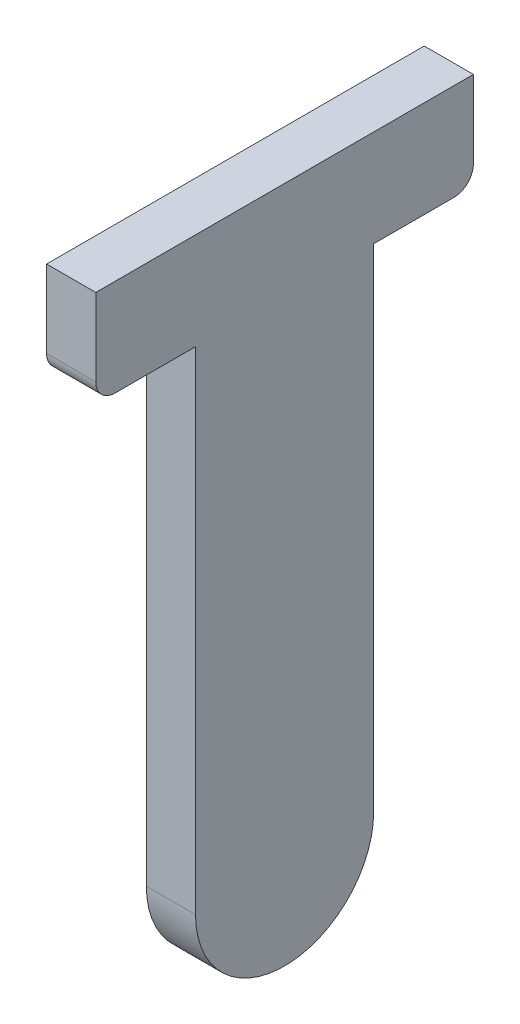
ISO-10303-21;
HEADER;
FILE_DESCRIPTION(('STEP AP214'),'2;1');
FILE_NAME('part.step','',(''),(''),'','','');
FILE_SCHEMA(('AUTOMOTIVE_DESIGN { 1 0 10303 214 1 1 1 1 }'));
ENDSEC;
DATA;
#1=APPLICATION_CONTEXT('core data for automotive mechanical design processes');
#2=APPLICATION_PROTOCOL_DEFINITION('international standard','automotive_design',2000,#1);
#3=PRODUCT_CONTEXT('',#1,'mechanical');
#4=PRODUCT('Part','Part','',(#3));
#5=PRODUCT_RELATED_PRODUCT_CATEGORY('part','',(#4));
#6=PRODUCT_DEFINITION_FORMATION('','',#4);
#7=PRODUCT_DEFINITION_CONTEXT('part definition',#1,'design');
#8=PRODUCT_DEFINITION('design','',#6,#7);
#9=PRODUCT_DEFINITION_SHAPE('','',#8);
#10=(LENGTH_UNIT() NAMED_UNIT(*) SI_UNIT(.MILLI.,.METRE.));
#11=(NAMED_UNIT(*) PLANE_ANGLE_UNIT() SI_UNIT($,.RADIAN.));
#12=(NAMED_UNIT(*) SI_UNIT($,.STERADIAN.) SOLID_ANGLE_UNIT());
#13=UNCERTAINTY_MEASURE_WITH_UNIT(LENGTH_MEASURE(1.E-05),#10,'distance_accuracy_value','');
#14=(GEOMETRIC_REPRESENTATION_CONTEXT(3) GLOBAL_UNCERTAINTY_ASSIGNED_CONTEXT((#13)) GLOBAL_UNIT_ASSIGNED_CONTEXT((#10,
#11,#12)) REPRESENTATION_CONTEXT('',''));
#15=CARTESIAN_POINT('',(0.,0.,0.));
#16=DIRECTION('',(0.,0.,1.));
#17=DIRECTION('',(1.,0.,0.));
#18=AXIS2_PLACEMENT_3D('',#15,#16,#17);
#19=CARTESIAN_POINT('',(7.25,0.,0.));
#20=DIRECTION('',(1.,0.,0.));
#21=DIRECTION('',(0.,0.,-1.));
#22=AXIS2_PLACEMENT_3D('',#19,#20,#21);
#23=PLANE('',#22);
#24=DIRECTION('',(0.,0.,1.));
#25=VECTOR('',#24,1.);
#26=CARTESIAN_POINT('',(7.25,-9.21,-17.475));
#27=LINE('',#26,#25);
#28=CARTESIAN_POINT('',(7.25,-9.21,-15.525));
#29=VERTEX_POINT('',#28);
#30=CARTESIAN_POINT('',(7.25,-9.21,-17.475));
#31=VERTEX_POINT('',#30);
#32=EDGE_CURVE('E84',#29,#31,#27,.F.);
#33=ORIENTED_EDGE('',*,*,#32,.F.);
#34=DIRECTION('',(0.,1.,0.));
#35=VECTOR('',#34,1.);
#36=CARTESIAN_POINT('',(7.25,0.,-15.525));
#37=LINE('',#36,#35);
#38=CARTESIAN_POINT('',(7.25,-9.61,-15.525));
#39=VERTEX_POINT('',#38);
#40=EDGE_CURVE('E99',#29,#39,#37,.F.);
#41=ORIENTED_EDGE('',*,*,#40,.T.);
#42=CARTESIAN_POINT('',(7.25,-9.61,-15.625));
#43=DIRECTION('',(-1.,0.,0.));
#44=DIRECTION('',(0.,0.,1.));
#45=AXIS2_PLACEMENT_3D('',#42,#43,#44);
#46=CIRCLE('',#45,0.1);
#47=CARTESIAN_POINT('',(7.25,-9.71,-15.625));
#48=VERTEX_POINT('',#47);
#49=EDGE_CURVE('E20',#39,#48,#46,.F.);
#50=ORIENTED_EDGE('',*,*,#49,.T.);
#51=DIRECTION('',(0.,0.,-1.));
#52=VECTOR('',#51,1.);
#53=CARTESIAN_POINT('',(7.25,-9.71,0.));
#54=LINE('',#53,#52);
#55=CARTESIAN_POINT('',(7.25,-9.71,-16.04));
#56=VERTEX_POINT('',#55);
#57=EDGE_CURVE('E77',#48,#56,#54,.T.);
#58=ORIENTED_EDGE('',*,*,#57,.T.);
#59=DIRECTION('',(0.,1.,0.));
#60=VECTOR('',#59,1.);
#61=CARTESIAN_POINT('',(7.25,-9.71,-16.04));
#62=LINE('',#61,#60);
#63=CARTESIAN_POINT('',(7.25,-12.25,-16.04));
#64=VERTEX_POINT('',#63);
#65=EDGE_CURVE('E96',#64,#56,#62,.T.);
#66=ORIENTED_EDGE('',*,*,#65,.F.);
#67=CARTESIAN_POINT('',(7.25,-12.25,-16.5));
#68=DIRECTION('',(-1.,0.,0.));
#69=DIRECTION('',(0.,0.,1.));
#70=AXIS2_PLACEMENT_3D('',#67,#68,#69);
#71=CIRCLE('',#70,0.46);
#72=CARTESIAN_POINT('',(7.25,-12.25,-16.96));
#73=VERTEX_POINT('',#72);
#74=EDGE_CURVE('E122',#73,#64,#71,.T.);
#75=ORIENTED_EDGE('',*,*,#74,.F.);
#76=DIRECTION('',(0.,1.,0.));
#77=VECTOR('',#76,1.);
#78=CARTESIAN_POINT('',(7.25,-12.25,-16.96));
#79=LINE('',#78,#77);
#80=CARTESIAN_POINT('',(7.25,-9.71,-16.96));
#81=VERTEX_POINT('',#80);
#82=EDGE_CURVE('E126',#81,#73,#79,.F.);
#83=ORIENTED_EDGE('',*,*,#82,.F.);
#84=DIRECTION('',(0.,0.,-1.));
#85=VECTOR('',#84,1.);
#86=CARTESIAN_POINT('',(7.25,-9.71,-16.96));
#87=LINE('',#86,#85);
#88=CARTESIAN_POINT('',(7.25,-9.71,-17.375));
#89=VERTEX_POINT('',#88);
#90=EDGE_CURVE('E130',#89,#81,#87,.F.);
#91=ORIENTED_EDGE('',*,*,#90,.F.);
#92=CARTESIAN_POINT('',(7.25,-9.61,-17.375));
#93=DIRECTION('',(-1.,0.,0.));
#94=DIRECTION('',(0.,0.,1.));
#95=AXIS2_PLACEMENT_3D('',#92,#93,#94);
#96=CIRCLE('',#95,0.1);
#97=CARTESIAN_POINT('',(7.25,-9.61,-17.475));
#98=VERTEX_POINT('',#97);
#99=EDGE_CURVE('E136',#98,#89,#96,.T.);
#100=ORIENTED_EDGE('',*,*,#99,.F.);
#101=DIRECTION('',(0.,1.,0.));
#102=VECTOR('',#101,1.);
#103=CARTESIAN_POINT('',(7.25,-9.61,-17.475));
#104=LINE('',#103,#102);
#105=EDGE_CURVE('E140',#31,#98,#104,.F.);
#106=ORIENTED_EDGE('',*,*,#105,.F.);
#107=EDGE_LOOP('',(#33,#41,#50,#58,#66,#75,#83,#91,#100,#106));
#108=FACE_BOUND('',#107,.T.);
#109=ADVANCED_FACE('F17',(#108),#23,.T.);
#110=CARTESIAN_POINT('',(7.25,-9.21,-17.475));
#111=DIRECTION('',(0.,1.,0.));
#112=DIRECTION('',(0.,0.,1.));
#113=AXIS2_PLACEMENT_3D('',#110,#111,#112);
#114=PLANE('',#113);
#115=DIRECTION('',(1.,0.,0.));
#116=VECTOR('',#115,1.);
#117=CARTESIAN_POINT('',(7.25,-9.21,-15.525));
#118=LINE('',#117,#116);
#119=CARTESIAN_POINT('',(6.996,-9.21,-15.525));
#120=VERTEX_POINT('',#119);
#121=EDGE_CURVE('E115',#29,#120,#118,.F.);
#122=ORIENTED_EDGE('',*,*,#121,.F.);
#123=ORIENTED_EDGE('',*,*,#32,.T.);
#124=DIRECTION('',(-1.,0.,0.));
#125=VECTOR('',#124,1.);
#126=CARTESIAN_POINT('',(7.25,-9.21,-17.475));
#127=LINE('',#126,#125);
#128=CARTESIAN_POINT('',(6.996,-9.21,-17.475));
#129=VERTEX_POINT('',#128);
#130=EDGE_CURVE('E141',#129,#31,#127,.F.);
#131=ORIENTED_EDGE('',*,*,#130,.F.);
#132=DIRECTION('',(0.,0.,1.));
#133=VECTOR('',#132,1.);
#134=CARTESIAN_POINT('',(6.996,-9.21,0.));
#135=LINE('',#134,#133);
#136=EDGE_CURVE('E198',#120,#129,#135,.F.);
#137=ORIENTED_EDGE('',*,*,#136,.F.);
#138=EDGE_LOOP('',(#122,#123,#131,#137));
#139=FACE_BOUND('',#138,.T.);
#140=ADVANCED_FACE('F303',(#139),#114,.T.);
#141=CARTESIAN_POINT('',(7.25,-9.61,-17.475));
#142=DIRECTION('',(0.,0.,-1.));
#143=DIRECTION('',(-1.,0.,0.));
#144=AXIS2_PLACEMENT_3D('',#141,#142,#143);
#145=PLANE('',#144);
#146=ORIENTED_EDGE('',*,*,#130,.T.);
#147=ORIENTED_EDGE('',*,*,#105,.T.);
#148=DIRECTION('',(-1.,0.,0.));
#149=VECTOR('',#148,1.);
#150=CARTESIAN_POINT('',(7.25,-9.61,-17.475));
#151=LINE('',#150,#149);
#152=CARTESIAN_POINT('',(6.996,-9.61,-17.475));
#153=VERTEX_POINT('',#152);
#154=EDGE_CURVE('E137',#153,#98,#151,.F.);
#155=ORIENTED_EDGE('',*,*,#154,.F.);
#156=DIRECTION('',(0.,1.,0.));
#157=VECTOR('',#156,1.);
#158=CARTESIAN_POINT('',(6.996,-0.754,-17.475));
#159=LINE('',#158,#157);
#160=EDGE_CURVE('E177',#129,#153,#159,.F.);
#161=ORIENTED_EDGE('',*,*,#160,.F.);
#162=EDGE_LOOP('',(#146,#147,#155,#161));
#163=FACE_BOUND('',#162,.T.);
#164=ADVANCED_FACE('F294',(#163),#145,.T.);
#165=CARTESIAN_POINT('',(7.25,-9.61,-17.375));
#166=DIRECTION('',(-1.,0.,0.));
#167=DIRECTION('',(0.,0.,1.));
#168=AXIS2_PLACEMENT_3D('',#165,#166,#167);
#169=CYLINDRICAL_SURFACE('',#168,0.1);
#170=ORIENTED_EDGE('',*,*,#154,.T.);
#171=ORIENTED_EDGE('',*,*,#99,.T.);
#172=DIRECTION('',(1.,0.,0.));
#173=VECTOR('',#172,1.);
#174=CARTESIAN_POINT('',(7.25,-9.71,-17.375));
#175=LINE('',#174,#173);
#176=CARTESIAN_POINT('',(6.996,-9.71,-17.375));
#177=VERTEX_POINT('',#176);
#178=EDGE_CURVE('E133',#177,#89,#175,.T.);
#179=ORIENTED_EDGE('',*,*,#178,.F.);
#180=CARTESIAN_POINT('',(6.996,-9.61,-17.375));
#181=DIRECTION('',(-1.,0.,0.));
#182=DIRECTION('',(0.,0.,1.));
#183=AXIS2_PLACEMENT_3D('',#180,#181,#182);
#184=CIRCLE('',#183,0.1);
#185=EDGE_CURVE('E173',#153,#177,#184,.T.);
#186=ORIENTED_EDGE('',*,*,#185,.F.);
#187=EDGE_LOOP('',(#170,#171,#179,#186));
#188=FACE_BOUND('',#187,.T.);
#189=ADVANCED_FACE('F181',(#188),#169,.T.);
#190=CARTESIAN_POINT('',(7.25,-9.71,-16.96));
#191=DIRECTION('',(0.,-1.,0.));
#192=DIRECTION('',(0.,0.,-1.));
#193=AXIS2_PLACEMENT_3D('',#190,#191,#192);
#194=PLANE('',#193);
#195=ORIENTED_EDGE('',*,*,#178,.T.);
#196=ORIENTED_EDGE('',*,*,#90,.T.);
#197=DIRECTION('',(-1.,0.,0.));
#198=VECTOR('',#197,1.);
#199=CARTESIAN_POINT('',(7.25,-9.71,-16.96));
#200=LINE('',#199,#198);
#201=CARTESIAN_POINT('',(6.996,-9.71,-16.96));
#202=VERTEX_POINT('',#201);
#203=EDGE_CURVE('E127',#202,#81,#200,.F.);
#204=ORIENTED_EDGE('',*,*,#203,.F.);
#205=DIRECTION('',(0.,0.,1.));
#206=VECTOR('',#205,1.);
#207=CARTESIAN_POINT('',(6.996,-9.71,0.));
#208=LINE('',#207,#206);
#209=EDGE_CURVE('E176',#177,#202,#208,.T.);
#210=ORIENTED_EDGE('',*,*,#209,.F.);
#211=EDGE_LOOP('',(#195,#196,#204,#210));
#212=FACE_BOUND('',#211,.T.);
#213=ADVANCED_FACE('F187',(#212),#194,.T.);
#214=CARTESIAN_POINT('',(7.25,-12.25,-16.96));
#215=DIRECTION('',(0.,0.,-1.));
#216=DIRECTION('',(-1.,0.,0.));
#217=AXIS2_PLACEMENT_3D('',#214,#215,#216);
#218=PLANE('',#217);
#219=ORIENTED_EDGE('',*,*,#203,.T.);
#220=ORIENTED_EDGE('',*,*,#82,.T.);
#221=DIRECTION('',(-1.,0.,0.));
#222=VECTOR('',#221,1.);
#223=CARTESIAN_POINT('',(7.25,-12.25,-16.96));
#224=LINE('',#223,#222);
#225=CARTESIAN_POINT('',(6.996,-12.25,-16.96));
#226=VERTEX_POINT('',#225);
#227=EDGE_CURVE('E123',#226,#73,#224,.F.);
#228=ORIENTED_EDGE('',*,*,#227,.F.);
#229=DIRECTION('',(0.,1.,0.));
#230=VECTOR('',#229,1.);
#231=CARTESIAN_POINT('',(6.996,-0.754,-16.96));
#232=LINE('',#231,#230);
#233=EDGE_CURVE('E172',#202,#226,#232,.F.);
#234=ORIENTED_EDGE('',*,*,#233,.F.);
#235=EDGE_LOOP('',(#219,#220,#228,#234));
#236=FACE_BOUND('',#235,.T.);
#237=ADVANCED_FACE('F267',(#236),#218,.T.);
#238=CARTESIAN_POINT('',(7.25,-12.25,-16.5));
#239=DIRECTION('',(-1.,0.,0.));
#240=DIRECTION('',(0.,0.,1.));
#241=AXIS2_PLACEMENT_3D('',#238,#239,#240);
#242=CYLINDRICAL_SURFACE('',#241,0.46);
#243=ORIENTED_EDGE('',*,*,#227,.T.);
#244=ORIENTED_EDGE('',*,*,#74,.T.);
#245=DIRECTION('',(1.,0.,0.));
#246=VECTOR('',#245,1.);
#247=CARTESIAN_POINT('',(7.25,-12.25,-16.04));
#248=LINE('',#247,#246);
#249=CARTESIAN_POINT('',(6.996,-12.25,-16.04));
#250=VERTEX_POINT('',#249);
#251=EDGE_CURVE('E107',#250,#64,#248,.T.);
#252=ORIENTED_EDGE('',*,*,#251,.F.);
#253=CARTESIAN_POINT('',(6.996,-12.25,-16.5));
#254=DIRECTION('',(-1.,0.,0.));
#255=DIRECTION('',(0.,0.,1.));
#256=AXIS2_PLACEMENT_3D('',#253,#254,#255);
#257=CIRCLE('',#256,0.46);
#258=EDGE_CURVE('E168',#226,#250,#257,.T.);
#259=ORIENTED_EDGE('',*,*,#258,.F.);
#260=EDGE_LOOP('',(#243,#244,#252,#259));
#261=FACE_BOUND('',#260,.T.);
#262=ADVANCED_FACE('F258',(#261),#242,.T.);
#263=CARTESIAN_POINT('',(7.25,-9.71,-16.04));
#264=DIRECTION('',(0.,0.,1.));
#265=DIRECTION('',(1.,0.,0.));
#266=AXIS2_PLACEMENT_3D('',#263,#264,#265);
#267=PLANE('',#266);
#268=ORIENTED_EDGE('',*,*,#251,.T.);
#269=ORIENTED_EDGE('',*,*,#65,.T.);
#270=DIRECTION('',(1.,0.,0.));
#271=VECTOR('',#270,1.);
#272=CARTESIAN_POINT('',(7.25,-9.71,-16.04));
#273=LINE('',#272,#271);
#274=CARTESIAN_POINT('',(6.996,-9.71,-16.04));
#275=VERTEX_POINT('',#274);
#276=EDGE_CURVE('E105',#275,#56,#273,.T.);
#277=ORIENTED_EDGE('',*,*,#276,.F.);
#278=DIRECTION('',(0.,1.,0.));
#279=VECTOR('',#278,1.);
#280=CARTESIAN_POINT('',(6.996,-0.754,-16.04));
#281=LINE('',#280,#279);
#282=EDGE_CURVE('E171',#250,#275,#281,.T.);
#283=ORIENTED_EDGE('',*,*,#282,.F.);
#284=EDGE_LOOP('',(#268,#269,#277,#283));
#285=FACE_BOUND('',#284,.T.);
#286=ADVANCED_FACE('F103',(#285),#267,.T.);
#287=CARTESIAN_POINT('',(7.25,-9.71,-15.625));
#288=DIRECTION('',(0.,-1.,0.));
#289=DIRECTION('',(0.,0.,-1.));
#290=AXIS2_PLACEMENT_3D('',#287,#288,#289);
#291=PLANE('',#290);
#292=ORIENTED_EDGE('',*,*,#276,.T.);
#293=ORIENTED_EDGE('',*,*,#57,.F.);
#294=DIRECTION('',(-1.,0.,0.));
#295=VECTOR('',#294,1.);
#296=CARTESIAN_POINT('',(7.25,-9.71,-15.625));
#297=LINE('',#296,#295);
#298=CARTESIAN_POINT('',(6.996,-9.71,-15.625));
#299=VERTEX_POINT('',#298);
#300=EDGE_CURVE('E113',#299,#48,#297,.F.);
#301=ORIENTED_EDGE('',*,*,#300,.F.);
#302=DIRECTION('',(0.,0.,1.));
#303=VECTOR('',#302,1.);
#304=CARTESIAN_POINT('',(6.996,-9.71,0.));
#305=LINE('',#304,#303);
#306=EDGE_CURVE('E111',#275,#299,#305,.T.);
#307=ORIENTED_EDGE('',*,*,#306,.F.);
#308=EDGE_LOOP('',(#292,#293,#301,#307));
#309=FACE_BOUND('',#308,.T.);
#310=ADVANCED_FACE('F109',(#309),#291,.T.);
#311=CARTESIAN_POINT('',(7.25,-9.61,-15.625));
#312=DIRECTION('',(-1.,0.,0.));
#313=DIRECTION('',(0.,0.,1.));
#314=AXIS2_PLACEMENT_3D('',#311,#312,#313);
#315=CYLINDRICAL_SURFACE('',#314,0.1);
#316=ORIENTED_EDGE('',*,*,#300,.T.);
#317=ORIENTED_EDGE('',*,*,#49,.F.);
#318=DIRECTION('',(1.,0.,0.));
#319=VECTOR('',#318,1.);
#320=CARTESIAN_POINT('',(7.25,-9.61,-15.525));
#321=LINE('',#320,#319);
#322=CARTESIAN_POINT('',(6.996,-9.61,-15.525));
#323=VERTEX_POINT('',#322);
#324=EDGE_CURVE('E35',#323,#39,#321,.T.);
#325=ORIENTED_EDGE('',*,*,#324,.F.);
#326=CARTESIAN_POINT('',(6.996,-9.61,-15.625));
#327=DIRECTION('',(-1.,0.,0.));
#328=DIRECTION('',(0.,0.,1.));
#329=AXIS2_PLACEMENT_3D('',#326,#327,#328);
#330=CIRCLE('',#329,0.1);
#331=EDGE_CURVE('E26',#299,#323,#330,.T.);
#332=ORIENTED_EDGE('',*,*,#331,.F.);
#333=EDGE_LOOP('',(#316,#317,#325,#332));
#334=FACE_BOUND('',#333,.T.);
#335=ADVANCED_FACE('F215',(#334),#315,.T.);
#336=CARTESIAN_POINT('',(7.25,-9.21,-15.525));
#337=DIRECTION('',(0.,0.,1.));
#338=DIRECTION('',(1.,0.,0.));
#339=AXIS2_PLACEMENT_3D('',#336,#337,#338);
#340=PLANE('',#339);
#341=ORIENTED_EDGE('',*,*,#324,.T.);
#342=ORIENTED_EDGE('',*,*,#40,.F.);
#343=ORIENTED_EDGE('',*,*,#121,.T.);
#344=DIRECTION('',(0.,1.,0.));
#345=VECTOR('',#344,1.);
#346=CARTESIAN_POINT('',(6.996,-0.754,-15.525));
#347=LINE('',#346,#345);
#348=EDGE_CURVE('E11',#323,#120,#347,.T.);
#349=ORIENTED_EDGE('',*,*,#348,.F.);
#350=EDGE_LOOP('',(#341,#342,#343,#349));
#351=FACE_BOUND('',#350,.T.);
#352=ADVANCED_FACE('F213',(#351),#340,.T.);
#353=CARTESIAN_POINT('',(6.996,-0.754,0.));
#354=DIRECTION('',(-1.,0.,0.));
#355=DIRECTION('',(0.,0.,1.));
#356=AXIS2_PLACEMENT_3D('',#353,#354,#355);
#357=PLANE('',#356);
#358=ORIENTED_EDGE('',*,*,#331,.T.);
#359=ORIENTED_EDGE('',*,*,#348,.T.);
#360=ORIENTED_EDGE('',*,*,#136,.T.);
#361=ORIENTED_EDGE('',*,*,#160,.T.);
#362=ORIENTED_EDGE('',*,*,#185,.T.);
#363=ORIENTED_EDGE('',*,*,#209,.T.);
#364=ORIENTED_EDGE('',*,*,#233,.T.);
#365=ORIENTED_EDGE('',*,*,#258,.T.);
#366=ORIENTED_EDGE('',*,*,#282,.T.);
#367=ORIENTED_EDGE('',*,*,#306,.T.);
#368=EDGE_LOOP('',(#358,#359,#360,#361,#362,#363,#364,#365,#366,#367));
#369=FACE_BOUND('',#368,.T.);
#370=ADVANCED_FACE('F194',(#369),#357,.T.);
#371=CLOSED_SHELL('',(#109,#140,#164,#189,#213,#237,#262,#286,#310,#335,#352,#370));
#372=MANIFOLD_SOLID_BREP('B1',#371);
#373=ADVANCED_BREP_SHAPE_REPRESENTATION('',(#18,#372),#14);
#374=SHAPE_DEFINITION_REPRESENTATION(#9,#373);
ENDSEC;
END-ISO-10303-21;
